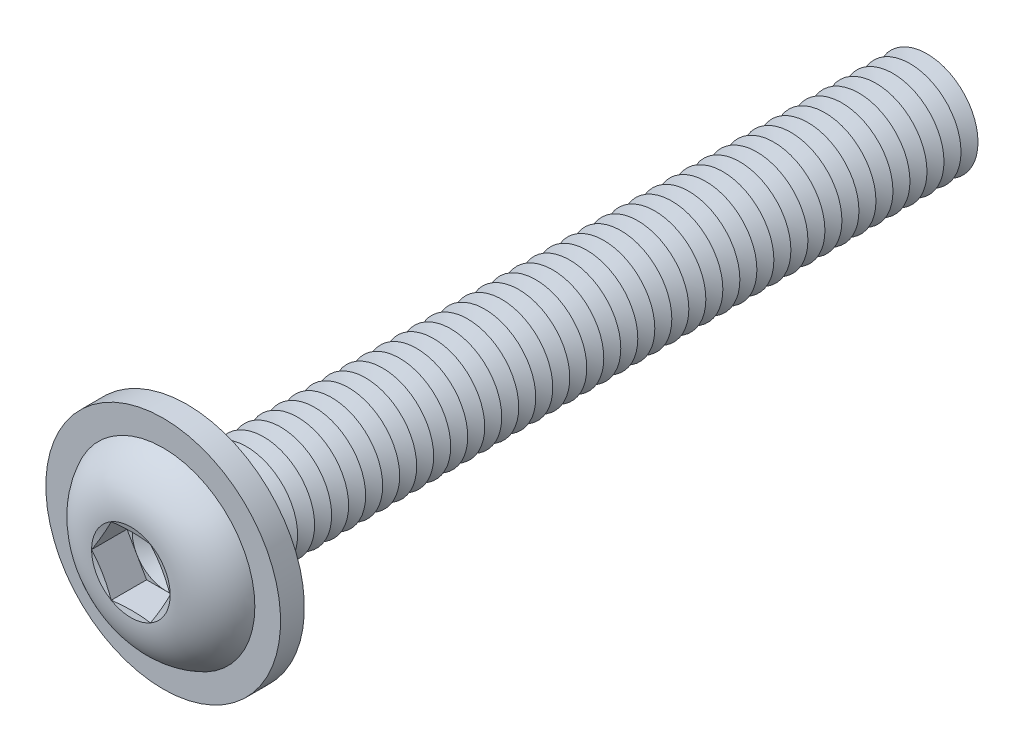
from build123d import *

# Parameters (mm, degrees)
FILLET1_R           = 0.25
LPATTERN1_COUNT     = 44
LPATTERN1_PITCH     = 0.5
CUT_EXTRUDE1_DEPTH  = 1.04
SKETCH5_R           = 3.45
SKETCH5_R_2         = 1.75
BOSS_EXTRUDE1_DEPTH = 0.7


with BuildPart() as part:
    # Sketch1 → Revolve1 (revolve)
    with BuildSketch(Plane(origin=(0, 0, 0), x_dir=(0, 0, -1), z_dir=(1, 0, 0)), mode=Mode.PRIVATE) as revolve1_sk:
        with BuildLine():
            Line((0, 1.5), (0, 2.85))
            ThreePointArc((0, 2.85), (-1.182850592, 2.35063849), (-1.65, 1.1547))
            Line((-1.65, 1.1547), (-1.495299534, 0.57735))
            Line((-1.495299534, 0.57735), (-1.65, 0.57735))
            Line((-1.65, 0.57735), (-1.65, 0))
            Line((-1.65, 0), (22, 0))
            Line((22, 0), (22, 1.5))
            Line((22, 1.5), (0, 1.5))
        make_face()
    revolve(revolve1_sk.sketch.rotate(Axis((0, 0, -22), (0, 0, 1)), 90), axis=Axis((0, 0, -22), (0, 0, 1)))

    # Fillet1
    fillet1_edges = [part.edges().sort_by_distance(p)[0] for p in [
        (1.5, 0, 0),
    ]]
    fillet(fillet1_edges, radius=FILLET1_R)

    # Sketch2 → Cut-Revolve1 (revolve, cut)
    with BuildSketch(Plane(origin=(0, 0, 0), x_dir=(0, 0, -1), z_dir=(1, 0, 0)), mode=Mode.PRIVATE) as cut_revolve1_sk:
        Polygon((21.75, 1.5), (22.25, 1.5), (22, 1.066987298), align=None)
    cut_revolve1 = revolve(cut_revolve1_sk.sketch.rotate(Axis((0, 0, -22), (0, 0, -1)), 270), axis=Axis((0, 0, -22), (0, 0, -1)), mode=Mode.SUBTRACT)

    # LPattern1: Cut-Revolve1 ×44
    with Locations(*[(0, 0, i * LPATTERN1_PITCH) for i in range(1, LPATTERN1_COUNT)]):
        add(cut_revolve1, mode=Mode.SUBTRACT)

    # Sketch3 → Cut-Extrude1 (cut)
    with BuildSketch(Plane.XY.offset(1.65)):
        Polygon((0.57735, 0.999999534), (-0.57735, 0.999999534), (-1.1547, 0), (-0.57735, -0.999999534), (0.57735, -0.999999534), (1.1547, 0), align=None)
    extrude(amount=-CUT_EXTRUDE1_DEPTH, mode=Mode.SUBTRACT)

    # Cut-Extrude2 cone 1 section (on through the dimple's axis) → Cut-Extrude2 (revolve, cut)
    with BuildSketch(Plane(origin=(0, 0, 0.61), x_dir=(0, -1, 0), z_dir=(1, 0, 0))):
        Polygon((0, 0), (0.999999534, 0), (0, 0.57735), align=None)
    revolve(axis=Axis((0, 0, 0.61), (0, 0, -1)), mode=Mode.SUBTRACT)

    # Sketch5 → Boss-Extrude1 (add)
    with BuildSketch(Plane(origin=(0, 0, 0), x_dir=(-1, 0, 0), z_dir=(0, 0, -1))):
        with Locations(Location((0, 0, 0), (0, 0, 90))):
            Circle(SKETCH5_R)
        Circle(SKETCH5_R_2, mode=Mode.SUBTRACT)
    extrude(amount=-BOSS_EXTRUDE1_DEPTH)


solid = part.part
